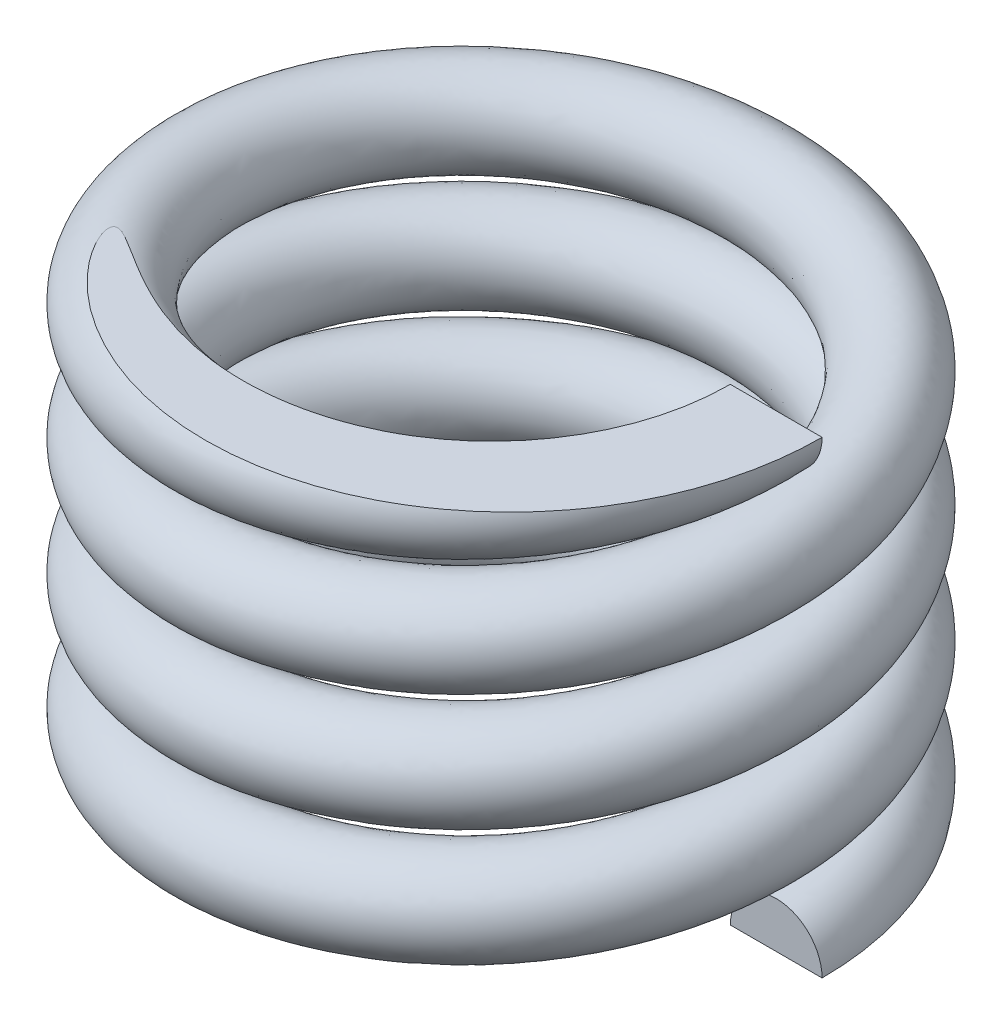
ISO-10303-21;
HEADER;
FILE_DESCRIPTION(('STEP AP214'),'2;1');
FILE_NAME('part.step','',(''),(''),'','','');
FILE_SCHEMA(('AUTOMOTIVE_DESIGN { 1 0 10303 214 1 1 1 1 }'));
ENDSEC;
DATA;
#1=APPLICATION_CONTEXT('core data for automotive mechanical design processes');
#2=APPLICATION_PROTOCOL_DEFINITION('international standard','automotive_design',2000,#1);
#3=PRODUCT_CONTEXT('',#1,'mechanical');
#4=PRODUCT('Part','Part','',(#3));
#5=PRODUCT_RELATED_PRODUCT_CATEGORY('part','',(#4));
#6=PRODUCT_DEFINITION_FORMATION('','',#4);
#7=PRODUCT_DEFINITION_CONTEXT('part definition',#1,'design');
#8=PRODUCT_DEFINITION('design','',#6,#7);
#9=PRODUCT_DEFINITION_SHAPE('','',#8);
#10=(LENGTH_UNIT() NAMED_UNIT(*) SI_UNIT(.MILLI.,.METRE.));
#11=(NAMED_UNIT(*) PLANE_ANGLE_UNIT() SI_UNIT($,.RADIAN.));
#12=(NAMED_UNIT(*) SI_UNIT($,.STERADIAN.) SOLID_ANGLE_UNIT());
#13=UNCERTAINTY_MEASURE_WITH_UNIT(LENGTH_MEASURE(1.E-05),#10,'distance_accuracy_value','');
#14=(GEOMETRIC_REPRESENTATION_CONTEXT(3) GLOBAL_UNCERTAINTY_ASSIGNED_CONTEXT((#13)) GLOBAL_UNIT_ASSIGNED_CONTEXT((#10,
#11,#12)) REPRESENTATION_CONTEXT('',''));
#15=CARTESIAN_POINT('',(0.,0.,0.));
#16=DIRECTION('',(0.,0.,1.));
#17=DIRECTION('',(1.,0.,0.));
#18=AXIS2_PLACEMENT_3D('',#15,#16,#17);
#19=CARTESIAN_POINT('',(1.5,2.55182105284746,0.));
#20=DIRECTION('',(0.,0.,1.));
#21=DIRECTION('',(1.,0.,0.));
#22=AXIS2_PLACEMENT_3D('',#19,#20,#21);
#23=PLANE('',#22);
#24=DIRECTION('',(-1.,0.,0.));
#25=VECTOR('',#24,1.);
#26=CARTESIAN_POINT('',(1.5,2.55182105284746,0.));
#27=LINE('',#26,#25);
#28=CARTESIAN_POINT('',(1.75,2.55182105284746,0.));
#29=VERTEX_POINT('',#28);
#30=CARTESIAN_POINT('',(1.25,2.55182105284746,0.));
#31=VERTEX_POINT('',#30);
#32=EDGE_CURVE('E50',#29,#31,#27,.T.);
#33=ORIENTED_EDGE('',*,*,#32,.F.);
#34=CARTESIAN_POINT('',(1.5,2.55182105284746,0.));
#35=DIRECTION('',(0.,0.,1.));
#36=DIRECTION('',(1.,0.,0.));
#37=AXIS2_PLACEMENT_3D('',#34,#35,#36);
#38=CIRCLE('',#37,0.25);
#39=EDGE_CURVE('E67',#31,#29,#38,.T.);
#40=ORIENTED_EDGE('',*,*,#39,.F.);
#41=EDGE_LOOP('',(#33,#40));
#42=FACE_BOUND('',#41,.T.);
#43=ADVANCED_FACE('F32',(#42),#23,.F.);
#44=CARTESIAN_POINT('',(1.75,0.,0.));
#45=CARTESIAN_POINT('',(1.75,0.0531629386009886,-1.01036297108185));
#46=CARTESIAN_POINT('',(0.875000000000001,0.106325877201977,-1.51554445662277));
#47=CARTESIAN_POINT('',(0.,0.159488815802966,-2.02072594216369));
#48=CARTESIAN_POINT('',(-0.875,0.212651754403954,-1.51554445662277));
#49=CARTESIAN_POINT('',(-1.75,0.265814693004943,-1.01036297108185));
#50=CARTESIAN_POINT('',(-1.75,0.318977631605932,0.));
#51=CARTESIAN_POINT('',(-1.75,0.37214057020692,1.01036297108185));
#52=CARTESIAN_POINT('',(-0.875000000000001,0.425303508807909,1.51554445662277));
#53=CARTESIAN_POINT('',(0.,0.478466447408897,2.02072594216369));
#54=CARTESIAN_POINT('',(0.874999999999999,0.531629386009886,1.51554445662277));
#55=CARTESIAN_POINT('',(1.75,0.584792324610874,1.01036297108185));
#56=CARTESIAN_POINT('',(1.75,0.637955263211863,0.));
#57=CARTESIAN_POINT('',(1.75,0.691118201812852,-1.01036297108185));
#58=CARTESIAN_POINT('',(0.875000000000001,0.74428114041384,-1.51554445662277));
#59=CARTESIAN_POINT('',(0.,0.797444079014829,-2.02072594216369));
#60=CARTESIAN_POINT('',(-0.875,0.850607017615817,-1.51554445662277));
#61=CARTESIAN_POINT('',(-1.75,0.903769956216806,-1.01036297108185));
#62=CARTESIAN_POINT('',(-1.75,0.956932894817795,0.));
#63=CARTESIAN_POINT('',(-1.75,1.01009583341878,1.01036297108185));
#64=CARTESIAN_POINT('',(-0.875000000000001,1.06325877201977,1.51554445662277));
#65=CARTESIAN_POINT('',(0.,1.11642171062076,2.02072594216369));
#66=CARTESIAN_POINT('',(0.874999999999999,1.16958464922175,1.51554445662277));
#67=CARTESIAN_POINT('',(1.75,1.22274758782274,1.01036297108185));
#68=CARTESIAN_POINT('',(1.75,1.27591052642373,0.));
#69=CARTESIAN_POINT('',(1.75,1.32907346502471,-1.01036297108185));
#70=CARTESIAN_POINT('',(0.875000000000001,1.3822364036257,-1.51554445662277));
#71=CARTESIAN_POINT('',(0.,1.43539934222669,-2.02072594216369));
#72=CARTESIAN_POINT('',(-0.875,1.48856228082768,-1.51554445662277));
#73=CARTESIAN_POINT('',(-1.75,1.54172521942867,-1.01036297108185));
#74=CARTESIAN_POINT('',(-1.75,1.59488815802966,0.));
#75=CARTESIAN_POINT('',(-1.75,1.64805109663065,1.01036297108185));
#76=CARTESIAN_POINT('',(-0.875000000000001,1.70121403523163,1.51554445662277));
#77=CARTESIAN_POINT('',(0.,1.75437697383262,2.02072594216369));
#78=CARTESIAN_POINT('',(0.874999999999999,1.80753991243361,1.51554445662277));
#79=CARTESIAN_POINT('',(1.75,1.8607028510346,1.01036297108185));
#80=CARTESIAN_POINT('',(1.75,1.91386578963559,0.));
#81=CARTESIAN_POINT('',(1.75,1.96702872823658,-1.01036297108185));
#82=CARTESIAN_POINT('',(0.875000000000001,2.02019166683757,-1.51554445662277));
#83=CARTESIAN_POINT('',(0.,2.07335460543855,-2.02072594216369));
#84=CARTESIAN_POINT('',(-0.875,2.12651754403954,-1.51554445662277));
#85=CARTESIAN_POINT('',(-1.75,2.17968048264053,-1.01036297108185));
#86=CARTESIAN_POINT('',(-1.75,2.23284342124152,0.));
#87=CARTESIAN_POINT('',(-1.75,2.28600635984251,1.01036297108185));
#88=CARTESIAN_POINT('',(-0.875000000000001,2.3391692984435,1.51554445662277));
#89=CARTESIAN_POINT('',(0.,2.39233223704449,2.02072594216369));
#90=CARTESIAN_POINT('',(0.874999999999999,2.44549517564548,1.51554445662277));
#91=CARTESIAN_POINT('',(1.75,2.49865811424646,1.01036297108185));
#92=CARTESIAN_POINT('',(1.75,2.55182105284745,0.));
#93=CARTESIAN_POINT('',(1.75,0.5,0.));
#94=CARTESIAN_POINT('',(1.75,0.553162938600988,-1.01036297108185));
#95=CARTESIAN_POINT('',(0.875000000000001,0.606325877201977,-1.51554445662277));
#96=CARTESIAN_POINT('',(0.,0.659488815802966,-2.02072594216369));
#97=CARTESIAN_POINT('',(-0.875,0.712651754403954,-1.51554445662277));
#98=CARTESIAN_POINT('',(-1.75,0.765814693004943,-1.01036297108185));
#99=CARTESIAN_POINT('',(-1.75,0.818977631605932,0.));
#100=CARTESIAN_POINT('',(-1.75,0.87214057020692,1.01036297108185));
#101=CARTESIAN_POINT('',(-0.875000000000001,0.925303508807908,1.51554445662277));
#102=CARTESIAN_POINT('',(0.,0.978466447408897,2.02072594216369));
#103=CARTESIAN_POINT('',(0.874999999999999,1.03162938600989,1.51554445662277));
#104=CARTESIAN_POINT('',(1.75,1.08479232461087,1.01036297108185));
#105=CARTESIAN_POINT('',(1.75,1.13795526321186,0.));
#106=CARTESIAN_POINT('',(1.75,1.19111820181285,-1.01036297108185));
#107=CARTESIAN_POINT('',(0.875000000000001,1.24428114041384,-1.51554445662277));
#108=CARTESIAN_POINT('',(0.,1.29744407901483,-2.02072594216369));
#109=CARTESIAN_POINT('',(-0.875,1.35060701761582,-1.51554445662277));
#110=CARTESIAN_POINT('',(-1.75,1.40376995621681,-1.01036297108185));
#111=CARTESIAN_POINT('',(-1.75,1.45693289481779,0.));
#112=CARTESIAN_POINT('',(-1.75,1.51009583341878,1.01036297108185));
#113=CARTESIAN_POINT('',(-0.875000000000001,1.56325877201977,1.51554445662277));
#114=CARTESIAN_POINT('',(0.,1.61642171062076,2.02072594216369));
#115=CARTESIAN_POINT('',(0.874999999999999,1.66958464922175,1.51554445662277));
#116=CARTESIAN_POINT('',(1.75,1.72274758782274,1.01036297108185));
#117=CARTESIAN_POINT('',(1.75,1.77591052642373,0.));
#118=CARTESIAN_POINT('',(1.75,1.82907346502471,-1.01036297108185));
#119=CARTESIAN_POINT('',(0.875000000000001,1.8822364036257,-1.51554445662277));
#120=CARTESIAN_POINT('',(0.,1.93539934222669,-2.02072594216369));
#121=CARTESIAN_POINT('',(-0.875,1.98856228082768,-1.51554445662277));
#122=CARTESIAN_POINT('',(-1.75,2.04172521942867,-1.01036297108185));
#123=CARTESIAN_POINT('',(-1.75,2.09488815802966,0.));
#124=CARTESIAN_POINT('',(-1.75,2.14805109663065,1.01036297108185));
#125=CARTESIAN_POINT('',(-0.875000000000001,2.20121403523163,1.51554445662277));
#126=CARTESIAN_POINT('',(0.,2.25437697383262,2.02072594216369));
#127=CARTESIAN_POINT('',(0.874999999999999,2.30753991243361,1.51554445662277));
#128=CARTESIAN_POINT('',(1.75,2.3607028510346,1.01036297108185));
#129=CARTESIAN_POINT('',(1.75,2.41386578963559,0.));
#130=CARTESIAN_POINT('',(1.75,2.46702872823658,-1.01036297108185));
#131=CARTESIAN_POINT('',(0.875000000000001,2.52019166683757,-1.51554445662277));
#132=CARTESIAN_POINT('',(0.,2.57335460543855,-2.02072594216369));
#133=CARTESIAN_POINT('',(-0.875,2.62651754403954,-1.51554445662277));
#134=CARTESIAN_POINT('',(-1.75,2.67968048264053,-1.01036297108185));
#135=CARTESIAN_POINT('',(-1.75,2.73284342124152,0.));
#136=CARTESIAN_POINT('',(-1.75,2.78600635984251,1.01036297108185));
#137=CARTESIAN_POINT('',(-0.875000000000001,2.8391692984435,1.51554445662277));
#138=CARTESIAN_POINT('',(0.,2.89233223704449,2.02072594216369));
#139=CARTESIAN_POINT('',(0.874999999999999,2.94549517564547,1.51554445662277));
#140=CARTESIAN_POINT('',(1.75,2.99865811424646,1.01036297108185));
#141=CARTESIAN_POINT('',(1.75,3.05182105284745,0.));
#142=CARTESIAN_POINT('',(1.25,0.5,0.));
#143=CARTESIAN_POINT('',(1.25,0.553162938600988,-0.721687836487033));
#144=CARTESIAN_POINT('',(0.625000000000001,0.606325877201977,-1.08253175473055));
#145=CARTESIAN_POINT('',(0.,0.659488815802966,-1.44337567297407));
#146=CARTESIAN_POINT('',(-0.625,0.712651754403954,-1.08253175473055));
#147=CARTESIAN_POINT('',(-1.25,0.765814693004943,-0.721687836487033));
#148=CARTESIAN_POINT('',(-1.25,0.818977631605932,0.));
#149=CARTESIAN_POINT('',(-1.25,0.87214057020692,0.721687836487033));
#150=CARTESIAN_POINT('',(-0.625000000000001,0.925303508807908,1.08253175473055));
#151=CARTESIAN_POINT('',(0.,0.978466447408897,1.44337567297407));
#152=CARTESIAN_POINT('',(0.625,1.03162938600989,1.08253175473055));
#153=CARTESIAN_POINT('',(1.25,1.08479232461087,0.721687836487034));
#154=CARTESIAN_POINT('',(1.25,1.13795526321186,0.));
#155=CARTESIAN_POINT('',(1.25,1.19111820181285,-0.721687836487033));
#156=CARTESIAN_POINT('',(0.625000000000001,1.24428114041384,-1.08253175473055));
#157=CARTESIAN_POINT('',(0.,1.29744407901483,-1.44337567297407));
#158=CARTESIAN_POINT('',(-0.625,1.35060701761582,-1.08253175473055));
#159=CARTESIAN_POINT('',(-1.25,1.40376995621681,-0.721687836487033));
#160=CARTESIAN_POINT('',(-1.25,1.45693289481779,0.));
#161=CARTESIAN_POINT('',(-1.25,1.51009583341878,0.721687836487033));
#162=CARTESIAN_POINT('',(-0.625000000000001,1.56325877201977,1.08253175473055));
#163=CARTESIAN_POINT('',(0.,1.61642171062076,1.44337567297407));
#164=CARTESIAN_POINT('',(0.625,1.66958464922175,1.08253175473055));
#165=CARTESIAN_POINT('',(1.25,1.72274758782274,0.721687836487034));
#166=CARTESIAN_POINT('',(1.25,1.77591052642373,0.));
#167=CARTESIAN_POINT('',(1.25,1.82907346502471,-0.721687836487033));
#168=CARTESIAN_POINT('',(0.625000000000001,1.8822364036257,-1.08253175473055));
#169=CARTESIAN_POINT('',(0.,1.93539934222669,-1.44337567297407));
#170=CARTESIAN_POINT('',(-0.625,1.98856228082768,-1.08253175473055));
#171=CARTESIAN_POINT('',(-1.25,2.04172521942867,-0.721687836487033));
#172=CARTESIAN_POINT('',(-1.25,2.09488815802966,0.));
#173=CARTESIAN_POINT('',(-1.25,2.14805109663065,0.721687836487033));
#174=CARTESIAN_POINT('',(-0.625000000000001,2.20121403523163,1.08253175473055));
#175=CARTESIAN_POINT('',(0.,2.25437697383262,1.44337567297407));
#176=CARTESIAN_POINT('',(0.625,2.30753991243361,1.08253175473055));
#177=CARTESIAN_POINT('',(1.25,2.3607028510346,0.721687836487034));
#178=CARTESIAN_POINT('',(1.25,2.41386578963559,0.));
#179=CARTESIAN_POINT('',(1.25,2.46702872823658,-0.721687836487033));
#180=CARTESIAN_POINT('',(0.625000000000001,2.52019166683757,-1.08253175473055));
#181=CARTESIAN_POINT('',(0.,2.57335460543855,-1.44337567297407));
#182=CARTESIAN_POINT('',(-0.625,2.62651754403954,-1.08253175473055));
#183=CARTESIAN_POINT('',(-1.25,2.67968048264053,-0.721687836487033));
#184=CARTESIAN_POINT('',(-1.25,2.73284342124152,0.));
#185=CARTESIAN_POINT('',(-1.25,2.78600635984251,0.721687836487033));
#186=CARTESIAN_POINT('',(-0.625000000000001,2.8391692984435,1.08253175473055));
#187=CARTESIAN_POINT('',(0.,2.89233223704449,1.44337567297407));
#188=CARTESIAN_POINT('',(0.625,2.94549517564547,1.08253175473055));
#189=CARTESIAN_POINT('',(1.25,2.99865811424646,0.721687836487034));
#190=CARTESIAN_POINT('',(1.25,3.05182105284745,0.));
#191=CARTESIAN_POINT('',(1.25,0.,0.));
#192=CARTESIAN_POINT('',(1.25,0.0531629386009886,-0.721687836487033));
#193=CARTESIAN_POINT('',(0.625000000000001,0.106325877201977,-1.08253175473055));
#194=CARTESIAN_POINT('',(0.,0.159488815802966,-1.44337567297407));
#195=CARTESIAN_POINT('',(-0.625,0.212651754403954,-1.08253175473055));
#196=CARTESIAN_POINT('',(-1.25,0.265814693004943,-0.721687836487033));
#197=CARTESIAN_POINT('',(-1.25,0.318977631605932,0.));
#198=CARTESIAN_POINT('',(-1.25,0.37214057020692,0.721687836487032));
#199=CARTESIAN_POINT('',(-0.625000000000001,0.425303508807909,1.08253175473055));
#200=CARTESIAN_POINT('',(0.,0.478466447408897,1.44337567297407));
#201=CARTESIAN_POINT('',(0.625,0.531629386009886,1.08253175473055));
#202=CARTESIAN_POINT('',(1.25,0.584792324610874,0.721687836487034));
#203=CARTESIAN_POINT('',(1.25,0.637955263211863,0.));
#204=CARTESIAN_POINT('',(1.25,0.691118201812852,-0.721687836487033));
#205=CARTESIAN_POINT('',(0.625000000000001,0.74428114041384,-1.08253175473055));
#206=CARTESIAN_POINT('',(0.,0.797444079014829,-1.44337567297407));
#207=CARTESIAN_POINT('',(-0.625,0.850607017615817,-1.08253175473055));
#208=CARTESIAN_POINT('',(-1.25,0.903769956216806,-0.721687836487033));
#209=CARTESIAN_POINT('',(-1.25,0.956932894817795,0.));
#210=CARTESIAN_POINT('',(-1.25,1.01009583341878,0.721687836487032));
#211=CARTESIAN_POINT('',(-0.625000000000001,1.06325877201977,1.08253175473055));
#212=CARTESIAN_POINT('',(0.,1.11642171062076,1.44337567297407));
#213=CARTESIAN_POINT('',(0.625,1.16958464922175,1.08253175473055));
#214=CARTESIAN_POINT('',(1.25,1.22274758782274,0.721687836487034));
#215=CARTESIAN_POINT('',(1.25,1.27591052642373,0.));
#216=CARTESIAN_POINT('',(1.25,1.32907346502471,-0.721687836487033));
#217=CARTESIAN_POINT('',(0.625000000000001,1.3822364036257,-1.08253175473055));
#218=CARTESIAN_POINT('',(0.,1.43539934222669,-1.44337567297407));
#219=CARTESIAN_POINT('',(-0.625,1.48856228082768,-1.08253175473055));
#220=CARTESIAN_POINT('',(-1.25,1.54172521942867,-0.721687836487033));
#221=CARTESIAN_POINT('',(-1.25,1.59488815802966,0.));
#222=CARTESIAN_POINT('',(-1.25,1.64805109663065,0.721687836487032));
#223=CARTESIAN_POINT('',(-0.625000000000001,1.70121403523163,1.08253175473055));
#224=CARTESIAN_POINT('',(0.,1.75437697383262,1.44337567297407));
#225=CARTESIAN_POINT('',(0.625,1.80753991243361,1.08253175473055));
#226=CARTESIAN_POINT('',(1.25,1.8607028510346,0.721687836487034));
#227=CARTESIAN_POINT('',(1.25,1.91386578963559,0.));
#228=CARTESIAN_POINT('',(1.25,1.96702872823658,-0.721687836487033));
#229=CARTESIAN_POINT('',(0.625000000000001,2.02019166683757,-1.08253175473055));
#230=CARTESIAN_POINT('',(0.,2.07335460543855,-1.44337567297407));
#231=CARTESIAN_POINT('',(-0.625,2.12651754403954,-1.08253175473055));
#232=CARTESIAN_POINT('',(-1.25,2.17968048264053,-0.721687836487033));
#233=CARTESIAN_POINT('',(-1.25,2.23284342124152,0.));
#234=CARTESIAN_POINT('',(-1.25,2.28600635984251,0.721687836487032));
#235=CARTESIAN_POINT('',(-0.625000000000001,2.3391692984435,1.08253175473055));
#236=CARTESIAN_POINT('',(0.,2.39233223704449,1.44337567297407));
#237=CARTESIAN_POINT('',(0.625,2.44549517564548,1.08253175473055));
#238=CARTESIAN_POINT('',(1.25,2.49865811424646,0.721687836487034));
#239=CARTESIAN_POINT('',(1.25,2.55182105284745,0.));
#240=CARTESIAN_POINT('',(1.25,-0.5,0.));
#241=CARTESIAN_POINT('',(1.25,-0.446837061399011,-0.721687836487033));
#242=CARTESIAN_POINT('',(0.625000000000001,-0.393674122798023,-1.08253175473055));
#243=CARTESIAN_POINT('',(0.,-0.340511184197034,-1.44337567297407));
#244=CARTESIAN_POINT('',(-0.625,-0.287348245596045,-1.08253175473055));
#245=CARTESIAN_POINT('',(-1.25,-0.234185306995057,-0.721687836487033));
#246=CARTESIAN_POINT('',(-1.25,-0.181022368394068,0.));
#247=CARTESIAN_POINT('',(-1.25,-0.12785942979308,0.721687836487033));
#248=CARTESIAN_POINT('',(-0.625000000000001,-0.074696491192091,1.08253175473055));
#249=CARTESIAN_POINT('',(0.,-0.0215335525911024,1.44337567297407));
#250=CARTESIAN_POINT('',(0.625,0.0316293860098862,1.08253175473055));
#251=CARTESIAN_POINT('',(1.25,0.0847923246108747,0.721687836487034));
#252=CARTESIAN_POINT('',(1.25,0.137955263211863,0.));
#253=CARTESIAN_POINT('',(1.25,0.191118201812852,-0.721687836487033));
#254=CARTESIAN_POINT('',(0.625000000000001,0.244281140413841,-1.08253175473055));
#255=CARTESIAN_POINT('',(0.,0.297444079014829,-1.44337567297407));
#256=CARTESIAN_POINT('',(-0.625,0.350607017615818,-1.08253175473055));
#257=CARTESIAN_POINT('',(-1.25,0.403769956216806,-0.721687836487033));
#258=CARTESIAN_POINT('',(-1.25,0.456932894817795,0.));
#259=CARTESIAN_POINT('',(-1.25,0.510095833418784,0.721687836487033));
#260=CARTESIAN_POINT('',(-0.625000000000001,0.563258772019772,1.08253175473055));
#261=CARTESIAN_POINT('',(0.,0.616421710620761,1.44337567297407));
#262=CARTESIAN_POINT('',(0.625,0.669584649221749,1.08253175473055));
#263=CARTESIAN_POINT('',(1.25,0.722747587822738,0.721687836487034));
#264=CARTESIAN_POINT('',(1.25,0.775910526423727,0.));
#265=CARTESIAN_POINT('',(1.25,0.829073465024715,-0.721687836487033));
#266=CARTESIAN_POINT('',(0.625000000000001,0.882236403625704,-1.08253175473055));
#267=CARTESIAN_POINT('',(0.,0.935399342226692,-1.44337567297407));
#268=CARTESIAN_POINT('',(-0.625,0.988562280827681,-1.08253175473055));
#269=CARTESIAN_POINT('',(-1.25,1.04172521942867,-0.721687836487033));
#270=CARTESIAN_POINT('',(-1.25,1.09488815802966,0.));
#271=CARTESIAN_POINT('',(-1.25,1.14805109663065,0.721687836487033));
#272=CARTESIAN_POINT('',(-0.625000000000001,1.20121403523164,1.08253175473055));
#273=CARTESIAN_POINT('',(0.,1.25437697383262,1.44337567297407));
#274=CARTESIAN_POINT('',(0.625,1.30753991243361,1.08253175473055));
#275=CARTESIAN_POINT('',(1.25,1.3607028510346,0.721687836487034));
#276=CARTESIAN_POINT('',(1.25,1.41386578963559,0.));
#277=CARTESIAN_POINT('',(1.25,1.46702872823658,-0.721687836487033));
#278=CARTESIAN_POINT('',(0.625000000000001,1.52019166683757,-1.08253175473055));
#279=CARTESIAN_POINT('',(0.,1.57335460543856,-1.44337567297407));
#280=CARTESIAN_POINT('',(-0.625,1.62651754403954,-1.08253175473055));
#281=CARTESIAN_POINT('',(-1.25,1.67968048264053,-0.721687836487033));
#282=CARTESIAN_POINT('',(-1.25,1.73284342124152,0.));
#283=CARTESIAN_POINT('',(-1.25,1.78600635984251,0.721687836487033));
#284=CARTESIAN_POINT('',(-0.625000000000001,1.8391692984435,1.08253175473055));
#285=CARTESIAN_POINT('',(0.,1.89233223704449,1.44337567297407));
#286=CARTESIAN_POINT('',(0.625,1.94549517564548,1.08253175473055));
#287=CARTESIAN_POINT('',(1.25,1.99865811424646,0.721687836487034));
#288=CARTESIAN_POINT('',(1.25,2.05182105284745,0.));
#289=CARTESIAN_POINT('',(1.75,-0.5,0.));
#290=CARTESIAN_POINT('',(1.75,-0.446837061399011,-1.01036297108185));
#291=CARTESIAN_POINT('',(0.875000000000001,-0.393674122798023,-1.51554445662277));
#292=CARTESIAN_POINT('',(0.,-0.340511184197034,-2.02072594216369));
#293=CARTESIAN_POINT('',(-0.875,-0.287348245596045,-1.51554445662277));
#294=CARTESIAN_POINT('',(-1.75,-0.234185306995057,-1.01036297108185));
#295=CARTESIAN_POINT('',(-1.75,-0.181022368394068,0.));
#296=CARTESIAN_POINT('',(-1.75,-0.12785942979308,1.01036297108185));
#297=CARTESIAN_POINT('',(-0.875000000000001,-0.074696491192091,1.51554445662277));
#298=CARTESIAN_POINT('',(0.,-0.0215335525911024,2.02072594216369));
#299=CARTESIAN_POINT('',(0.874999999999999,0.0316293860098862,1.51554445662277));
#300=CARTESIAN_POINT('',(1.75,0.0847923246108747,1.01036297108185));
#301=CARTESIAN_POINT('',(1.75,0.137955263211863,0.));
#302=CARTESIAN_POINT('',(1.75,0.191118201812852,-1.01036297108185));
#303=CARTESIAN_POINT('',(0.875000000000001,0.244281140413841,-1.51554445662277));
#304=CARTESIAN_POINT('',(0.,0.297444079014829,-2.02072594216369));
#305=CARTESIAN_POINT('',(-0.875,0.350607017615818,-1.51554445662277));
#306=CARTESIAN_POINT('',(-1.75,0.403769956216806,-1.01036297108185));
#307=CARTESIAN_POINT('',(-1.75,0.456932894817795,0.));
#308=CARTESIAN_POINT('',(-1.75,0.510095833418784,1.01036297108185));
#309=CARTESIAN_POINT('',(-0.875000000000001,0.563258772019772,1.51554445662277));
#310=CARTESIAN_POINT('',(0.,0.616421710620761,2.02072594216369));
#311=CARTESIAN_POINT('',(0.874999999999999,0.669584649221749,1.51554445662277));
#312=CARTESIAN_POINT('',(1.75,0.722747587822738,1.01036297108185));
#313=CARTESIAN_POINT('',(1.75,0.775910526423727,0.));
#314=CARTESIAN_POINT('',(1.75,0.829073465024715,-1.01036297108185));
#315=CARTESIAN_POINT('',(0.875000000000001,0.882236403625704,-1.51554445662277));
#316=CARTESIAN_POINT('',(0.,0.935399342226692,-2.02072594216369));
#317=CARTESIAN_POINT('',(-0.875,0.988562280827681,-1.51554445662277));
#318=CARTESIAN_POINT('',(-1.75,1.04172521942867,-1.01036297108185));
#319=CARTESIAN_POINT('',(-1.75,1.09488815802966,0.));
#320=CARTESIAN_POINT('',(-1.75,1.14805109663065,1.01036297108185));
#321=CARTESIAN_POINT('',(-0.875000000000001,1.20121403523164,1.51554445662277));
#322=CARTESIAN_POINT('',(0.,1.25437697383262,2.02072594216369));
#323=CARTESIAN_POINT('',(0.874999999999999,1.30753991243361,1.51554445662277));
#324=CARTESIAN_POINT('',(1.75,1.3607028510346,1.01036297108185));
#325=CARTESIAN_POINT('',(1.75,1.41386578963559,0.));
#326=CARTESIAN_POINT('',(1.75,1.46702872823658,-1.01036297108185));
#327=CARTESIAN_POINT('',(0.875000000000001,1.52019166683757,-1.51554445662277));
#328=CARTESIAN_POINT('',(0.,1.57335460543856,-2.02072594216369));
#329=CARTESIAN_POINT('',(-0.875,1.62651754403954,-1.51554445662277));
#330=CARTESIAN_POINT('',(-1.75,1.67968048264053,-1.01036297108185));
#331=CARTESIAN_POINT('',(-1.75,1.73284342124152,0.));
#332=CARTESIAN_POINT('',(-1.75,1.78600635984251,1.01036297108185));
#333=CARTESIAN_POINT('',(-0.875000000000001,1.8391692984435,1.51554445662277));
#334=CARTESIAN_POINT('',(0.,1.89233223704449,2.02072594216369));
#335=CARTESIAN_POINT('',(0.874999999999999,1.94549517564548,1.51554445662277));
#336=CARTESIAN_POINT('',(1.75,1.99865811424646,1.01036297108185));
#337=CARTESIAN_POINT('',(1.75,2.05182105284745,0.));
#338=CARTESIAN_POINT('',(1.75,0.,0.));
#339=CARTESIAN_POINT('',(1.75,0.0531629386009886,-1.01036297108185));
#340=CARTESIAN_POINT('',(0.875000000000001,0.106325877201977,-1.51554445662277));
#341=CARTESIAN_POINT('',(0.,0.159488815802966,-2.02072594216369));
#342=CARTESIAN_POINT('',(-0.875,0.212651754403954,-1.51554445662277));
#343=CARTESIAN_POINT('',(-1.75,0.265814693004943,-1.01036297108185));
#344=CARTESIAN_POINT('',(-1.75,0.318977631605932,0.));
#345=CARTESIAN_POINT('',(-1.75,0.37214057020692,1.01036297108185));
#346=CARTESIAN_POINT('',(-0.875000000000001,0.425303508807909,1.51554445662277));
#347=CARTESIAN_POINT('',(0.,0.478466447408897,2.02072594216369));
#348=CARTESIAN_POINT('',(0.874999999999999,0.531629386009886,1.51554445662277));
#349=CARTESIAN_POINT('',(1.75,0.584792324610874,1.01036297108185));
#350=CARTESIAN_POINT('',(1.75,0.637955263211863,0.));
#351=CARTESIAN_POINT('',(1.75,0.691118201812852,-1.01036297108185));
#352=CARTESIAN_POINT('',(0.875000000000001,0.74428114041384,-1.51554445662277));
#353=CARTESIAN_POINT('',(0.,0.797444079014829,-2.02072594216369));
#354=CARTESIAN_POINT('',(-0.875,0.850607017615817,-1.51554445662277));
#355=CARTESIAN_POINT('',(-1.75,0.903769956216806,-1.01036297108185));
#356=CARTESIAN_POINT('',(-1.75,0.956932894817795,0.));
#357=CARTESIAN_POINT('',(-1.75,1.01009583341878,1.01036297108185));
#358=CARTESIAN_POINT('',(-0.875000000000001,1.06325877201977,1.51554445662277));
#359=CARTESIAN_POINT('',(0.,1.11642171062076,2.02072594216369));
#360=CARTESIAN_POINT('',(0.874999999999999,1.16958464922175,1.51554445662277));
#361=CARTESIAN_POINT('',(1.75,1.22274758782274,1.01036297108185));
#362=CARTESIAN_POINT('',(1.75,1.27591052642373,0.));
#363=CARTESIAN_POINT('',(1.75,1.32907346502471,-1.01036297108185));
#364=CARTESIAN_POINT('',(0.875000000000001,1.3822364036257,-1.51554445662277));
#365=CARTESIAN_POINT('',(0.,1.43539934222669,-2.02072594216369));
#366=CARTESIAN_POINT('',(-0.875,1.48856228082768,-1.51554445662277));
#367=CARTESIAN_POINT('',(-1.75,1.54172521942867,-1.01036297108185));
#368=CARTESIAN_POINT('',(-1.75,1.59488815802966,0.));
#369=CARTESIAN_POINT('',(-1.75,1.64805109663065,1.01036297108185));
#370=CARTESIAN_POINT('',(-0.875000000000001,1.70121403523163,1.51554445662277));
#371=CARTESIAN_POINT('',(0.,1.75437697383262,2.02072594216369));
#372=CARTESIAN_POINT('',(0.874999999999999,1.80753991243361,1.51554445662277));
#373=CARTESIAN_POINT('',(1.75,1.8607028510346,1.01036297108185));
#374=CARTESIAN_POINT('',(1.75,1.91386578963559,0.));
#375=CARTESIAN_POINT('',(1.75,1.96702872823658,-1.01036297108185));
#376=CARTESIAN_POINT('',(0.875000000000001,2.02019166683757,-1.51554445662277));
#377=CARTESIAN_POINT('',(0.,2.07335460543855,-2.02072594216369));
#378=CARTESIAN_POINT('',(-0.875,2.12651754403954,-1.51554445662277));
#379=CARTESIAN_POINT('',(-1.75,2.17968048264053,-1.01036297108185));
#380=CARTESIAN_POINT('',(-1.75,2.23284342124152,0.));
#381=CARTESIAN_POINT('',(-1.75,2.28600635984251,1.01036297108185));
#382=CARTESIAN_POINT('',(-0.875000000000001,2.3391692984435,1.51554445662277));
#383=CARTESIAN_POINT('',(0.,2.39233223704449,2.02072594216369));
#384=CARTESIAN_POINT('',(0.874999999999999,2.44549517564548,1.51554445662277));
#385=CARTESIAN_POINT('',(1.75,2.49865811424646,1.01036297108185));
#386=CARTESIAN_POINT('',(1.75,2.55182105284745,0.));
#387=(BOUNDED_SURFACE() B_SPLINE_SURFACE(3,2,((#44,#45,#46,#47,#48,#49,#50,#51,#52,#53,#54,#55,
#56,#57,#58,#59,#60,#61,#62,#63,#64,#65,#66,#67,#68,#69,#70,#71,#72,#73,#74,#75,#76,#77,#78,#79,
#80,#81,#82,#83,#84,#85,#86,#87,#88,#89,#90,#91,#92),(#93,#94,#95,#96,#97,#98,#99,#100,#101,
#102,#103,#104,#105,#106,#107,#108,#109,#110,#111,#112,#113,#114,#115,#116,#117,#118,#119,#120,
#121,#122,#123,#124,#125,#126,#127,#128,#129,#130,#131,#132,#133,#134,#135,#136,#137,#138,#139,
#140,#141),(#142,#143,#144,#145,#146,#147,#148,#149,#150,#151,#152,#153,#154,#155,#156,#157,
#158,#159,#160,#161,#162,#163,#164,#165,#166,#167,#168,#169,#170,#171,#172,#173,#174,#175,#176,
#177,#178,#179,#180,#181,#182,#183,#184,#185,#186,#187,#188,#189,#190),(#191,#192,#193,#194,
#195,#196,#197,#198,#199,#200,#201,#202,#203,#204,#205,#206,#207,#208,#209,#210,#211,#212,#213,
#214,#215,#216,#217,#218,#219,#220,#221,#222,#223,#224,#225,#226,#227,#228,#229,#230,#231,#232,
#233,#234,#235,#236,#237,#238,#239),(#240,#241,#242,#243,#244,#245,#246,#247,#248,#249,#250,
#251,#252,#253,#254,#255,#256,#257,#258,#259,#260,#261,#262,#263,#264,#265,#266,#267,#268,#269,
#270,#271,#272,#273,#274,#275,#276,#277,#278,#279,#280,#281,#282,#283,#284,#285,#286,#287,#288),
(#289,#290,#291,#292,#293,#294,#295,#296,#297,#298,#299,#300,#301,#302,#303,#304,#305,#306,#307,
#308,#309,#310,#311,#312,#313,#314,#315,#316,#317,#318,#319,#320,#321,#322,#323,#324,#325,#326,
#327,#328,#329,#330,#331,#332,#333,#334,#335,#336,#337),(#338,#339,#340,#341,#342,#343,#344,
#345,#346,#347,#348,#349,#350,#351,#352,#353,#354,#355,#356,#357,#358,#359,#360,#361,#362,#363,
#364,#365,#366,#367,#368,#369,#370,#371,#372,#373,#374,#375,#376,#377,#378,#379,#380,#381,#382,
#383,#384,#385,#386)),.UNSPECIFIED.,.T.,.F.,.F.) B_SPLINE_SURFACE_WITH_KNOTS((4,3,4),(3,2,2,2,2,
2,2,2,2,2,2,2,2,2,2,2,2,2,2,2,2,2,2,2,3),(0.,0.5,1.),(0.,0.0416666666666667,0.0833333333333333,
0.125,0.166666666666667,0.208333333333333,0.25,0.291666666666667,0.333333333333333,0.375,
0.416666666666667,0.458333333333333,0.5,0.541666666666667,0.583333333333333,0.625,
0.666666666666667,0.708333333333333,0.75,0.791666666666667,0.833333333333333,0.875,
0.916666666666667,0.958333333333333,1.),
.UNSPECIFIED.) GEOMETRIC_REPRESENTATION_ITEM() RATIONAL_B_SPLINE_SURFACE(((1.,0.866025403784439,
1.,0.866025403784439,1.,0.866025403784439,1.,0.866025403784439,1.,0.866025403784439,1.,
0.866025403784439,1.,0.866025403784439,1.,0.866025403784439,1.,0.866025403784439,1.,
0.866025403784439,1.,0.866025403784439,1.,0.866025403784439,1.,0.866025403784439,1.,
0.866025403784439,1.,0.866025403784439,1.,0.866025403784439,1.,0.866025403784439,1.,
0.866025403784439,1.,0.866025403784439,1.,0.866025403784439,1.,0.866025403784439,1.,
0.866025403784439,1.,0.866025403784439,1.,0.866025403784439,1.),(0.333333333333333,
0.288675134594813,0.333333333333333,0.288675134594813,0.333333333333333,0.288675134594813,
0.333333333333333,0.288675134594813,0.333333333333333,0.288675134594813,0.333333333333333,
0.288675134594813,0.333333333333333,0.288675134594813,0.333333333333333,0.288675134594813,
0.333333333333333,0.288675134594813,0.333333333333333,0.288675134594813,0.333333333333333,
0.288675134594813,0.333333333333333,0.288675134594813,0.333333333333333,0.288675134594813,
0.333333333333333,0.288675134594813,0.333333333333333,0.288675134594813,0.333333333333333,
0.288675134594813,0.333333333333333,0.288675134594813,0.333333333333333,0.288675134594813,
0.333333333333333,0.288675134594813,0.333333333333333,0.288675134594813,0.333333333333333,
0.288675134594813,0.333333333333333,0.288675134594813,0.333333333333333,0.288675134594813,
0.333333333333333,0.288675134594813,0.333333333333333),(0.333333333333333,0.288675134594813,
0.333333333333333,0.288675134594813,0.333333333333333,0.288675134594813,0.333333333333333,
0.288675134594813,0.333333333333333,0.288675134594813,0.333333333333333,0.288675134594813,
0.333333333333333,0.288675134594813,0.333333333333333,0.288675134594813,0.333333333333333,
0.288675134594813,0.333333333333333,0.288675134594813,0.333333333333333,0.288675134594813,
0.333333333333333,0.288675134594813,0.333333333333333,0.288675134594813,0.333333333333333,
0.288675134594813,0.333333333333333,0.288675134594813,0.333333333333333,0.288675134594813,
0.333333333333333,0.288675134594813,0.333333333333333,0.288675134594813,0.333333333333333,
0.288675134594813,0.333333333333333,0.288675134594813,0.333333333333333,0.288675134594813,
0.333333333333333,0.288675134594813,0.333333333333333,0.288675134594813,0.333333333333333,
0.288675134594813,0.333333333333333),(1.,0.866025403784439,1.,0.866025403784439,1.,
0.866025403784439,1.,0.866025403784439,1.,0.866025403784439,1.,0.866025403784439,1.,
0.866025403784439,1.,0.866025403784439,1.,0.866025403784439,1.,0.866025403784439,1.,
0.866025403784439,1.,0.866025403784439,1.,0.866025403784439,1.,0.866025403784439,1.,
0.866025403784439,1.,0.866025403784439,1.,0.866025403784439,1.,0.866025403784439,1.,
0.866025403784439,1.,0.866025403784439,1.,0.866025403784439,1.,0.866025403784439,1.,
0.866025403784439,1.,0.866025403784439,1.),(0.333333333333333,0.288675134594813,
0.333333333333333,0.288675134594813,0.333333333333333,0.288675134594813,0.333333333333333,
0.288675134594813,0.333333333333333,0.288675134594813,0.333333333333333,0.288675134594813,
0.333333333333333,0.288675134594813,0.333333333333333,0.288675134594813,0.333333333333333,
0.288675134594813,0.333333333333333,0.288675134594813,0.333333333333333,0.288675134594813,
0.333333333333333,0.288675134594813,0.333333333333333,0.288675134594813,0.333333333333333,
0.288675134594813,0.333333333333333,0.288675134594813,0.333333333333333,0.288675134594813,
0.333333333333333,0.288675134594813,0.333333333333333,0.288675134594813,0.333333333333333,
0.288675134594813,0.333333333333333,0.288675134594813,0.333333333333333,0.288675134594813,
0.333333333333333,0.288675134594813,0.333333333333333,0.288675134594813,0.333333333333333,
0.288675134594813,0.333333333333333),(0.333333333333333,0.288675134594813,0.333333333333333,
0.288675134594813,0.333333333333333,0.288675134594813,0.333333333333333,0.288675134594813,
0.333333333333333,0.288675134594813,0.333333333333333,0.288675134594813,0.333333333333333,
0.288675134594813,0.333333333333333,0.288675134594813,0.333333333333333,0.288675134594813,
0.333333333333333,0.288675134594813,0.333333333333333,0.288675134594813,0.333333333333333,
0.288675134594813,0.333333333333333,0.288675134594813,0.333333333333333,0.288675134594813,
0.333333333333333,0.288675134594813,0.333333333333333,0.288675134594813,0.333333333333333,
0.288675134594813,0.333333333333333,0.288675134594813,0.333333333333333,0.288675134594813,
0.333333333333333,0.288675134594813,0.333333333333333,0.288675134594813,0.333333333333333,
0.288675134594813,0.333333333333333,0.288675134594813,0.333333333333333,0.288675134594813,
0.333333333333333),(1.,0.866025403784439,1.,0.866025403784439,1.,0.866025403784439,1.,
0.866025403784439,1.,0.866025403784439,1.,0.866025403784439,1.,0.866025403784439,1.,
0.866025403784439,1.,0.866025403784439,1.,0.866025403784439,1.,0.866025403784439,1.,
0.866025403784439,1.,0.866025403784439,1.,0.866025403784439,1.,0.866025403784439,1.,
0.866025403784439,1.,0.866025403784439,1.,0.866025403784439,1.,0.866025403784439,1.,
0.866025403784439,1.,0.866025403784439,1.,0.866025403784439,1.,0.866025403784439,1.,
0.866025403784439,1.))) REPRESENTATION_ITEM('') SURFACE());
#388=CARTESIAN_POINT('',(1.5,0.,0.));
#389=DIRECTION('',(0.,0.,1.));
#390=DIRECTION('',(1.,0.,0.));
#391=AXIS2_PLACEMENT_3D('',#388,#389,#390);
#392=CIRCLE('',#391,0.25);
#393=CARTESIAN_POINT('',(1.75,0.,0.));
#394=VERTEX_POINT('',#393);
#395=CARTESIAN_POINT('',(1.25,0.,0.));
#396=VERTEX_POINT('',#395);
#397=EDGE_CURVE('E70',#394,#396,#392,.T.);
#398=CARTESIAN_POINT('',(1.75,0.,0.));
#399=CARTESIAN_POINT('',(1.74999988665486,0.,-0.0421168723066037));
#400=CARTESIAN_POINT('',(1.74844934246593,0.,-0.0842186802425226));
#401=CARTESIAN_POINT('',(1.74225273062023,0.,-0.168193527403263));
#402=CARTESIAN_POINT('',(1.73760667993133,0.,-0.210066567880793));
#403=CARTESIAN_POINT('',(1.71904743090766,0.,-0.334949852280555));
#404=CARTESIAN_POINT('',(1.70051310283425,-3.02700622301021E-13,-0.417321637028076));
#405=CARTESIAN_POINT('',(1.65147294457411,-3.1469692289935E-13,-0.578423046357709));
#406=CARTESIAN_POINT('',(1.62096267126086,0.,-0.657151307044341));
#407=CARTESIAN_POINT('',(1.54861182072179,0.,-0.809230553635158));
#408=CARTESIAN_POINT('',(1.50677008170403,0.,-0.882580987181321));
#409=CARTESIAN_POINT('',(1.40634810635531,0.,-1.03162623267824));
#410=CARTESIAN_POINT('',(1.34627703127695,0.,-1.10632064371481));
#411=CARTESIAN_POINT('',(1.21435349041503,0.,-1.24460601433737));
#412=CARTESIAN_POINT('',(1.14249387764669,0.,-1.30819018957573));
#413=CARTESIAN_POINT('',(1.02759665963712,0.,-1.3937510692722));
#414=CARTESIAN_POINT('',(0.988119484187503,0.,-1.42063213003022));
#415=CARTESIAN_POINT('',(0.907047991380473,0.,-1.4710102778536));
#416=CARTESIAN_POINT('',(0.865453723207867,0.,-1.4945074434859));
#417=CARTESIAN_POINT('',(0.780397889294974,0.,-1.53782451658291));
#418=CARTESIAN_POINT('',(0.736936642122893,0.,-1.55764504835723));
#419=CARTESIAN_POINT('',(0.648470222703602,0.,-1.59343380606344));
#420=CARTESIAN_POINT('',(0.603465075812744,0.,-1.60940209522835));
#421=CARTESIAN_POINT('',(0.467927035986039,0.,-1.65090271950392));
#422=CARTESIAN_POINT('',(0.375557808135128,0.,-1.67069774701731));
#423=CARTESIAN_POINT('',(0.188871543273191,0.,-1.69394314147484));
#424=CARTESIAN_POINT('',(0.0945555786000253,0.,-1.69740227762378));
#425=CARTESIAN_POINT('',(-0.0902151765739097,0.,-1.68785886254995));
#426=CARTESIAN_POINT('',(-0.180696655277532,0.,-1.67538169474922));
#427=CARTESIAN_POINT('',(-0.358303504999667,0.,-1.63497906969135));
#428=CARTESIAN_POINT('',(-0.445423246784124,0.,-1.60702880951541));
#429=CARTESIAN_POINT('',(-0.611303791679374,0.,-1.53706838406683));
#430=CARTESIAN_POINT('',(-0.690219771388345,0.,-1.49542971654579));
#431=CARTESIAN_POINT('',(-0.802046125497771,0.,-1.42323274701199));
#432=CARTESIAN_POINT('',(-0.838192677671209,0.,-1.39757882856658));
#433=CARTESIAN_POINT('',(-0.907698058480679,0.,-1.34277129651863));
#434=CARTESIAN_POINT('',(-0.941060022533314,0.,-1.31362171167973));
#435=CARTESIAN_POINT('',(-1.00114861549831,0.,-1.25505325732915));
#436=CARTESIAN_POINT('',(-1.0282046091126,2.33248085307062E-13,-1.2259747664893));
#437=CARTESIAN_POINT('',(-1.06621191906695,-1.16846035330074E-13,-1.18017863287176));
#438=CARTESIAN_POINT('',(-1.07846197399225,-3.28865280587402E-13,-1.16453430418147));
#439=CARTESIAN_POINT('',(-1.10191162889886,3.28605798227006E-13,-1.13249327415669));
#440=CARTESIAN_POINT('',(-1.1131120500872,1.1972429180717E-12,-1.11609717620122));
#441=CARTESIAN_POINT('',(-1.13421957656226,1.13843558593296E-12,-1.08243180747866));
#442=CARTESIAN_POINT('',(-1.14412463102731,2.08179019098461E-13,-1.06516121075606));
#443=CARTESIAN_POINT('',(-1.15743026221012,-1.03856484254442E-13,-1.03850625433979));
#444=CARTESIAN_POINT('',(-1.16160299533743,0.,-1.02950695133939));
#445=CARTESIAN_POINT('',(-1.16921959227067,0.,-1.01120876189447));
#446=CARTESIAN_POINT('',(-1.17266493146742,0.,-1.00191052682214));
#447=CARTESIAN_POINT('',(-1.17688693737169,0.,-0.98766940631));
#448=CARTESIAN_POINT('',(-1.17813743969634,0.,-0.982868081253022));
#449=CARTESIAN_POINT('',(-1.18015124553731,0.,-0.973171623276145));
#450=CARTESIAN_POINT('',(-1.18091661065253,0.,-0.96827697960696));
#451=CARTESIAN_POINT('',(-1.18150787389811,0.,-0.959798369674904));
#452=CARTESIAN_POINT('',(-1.18153615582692,0.,-0.956229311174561));
#453=CARTESIAN_POINT('',(-1.18082018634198,0.,-0.949083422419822));
#454=CARTESIAN_POINT('',(-1.18007029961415,0.,-0.945506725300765));
#455=CARTESIAN_POINT('',(-1.17770199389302,0.,-0.940262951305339));
#456=CARTESIAN_POINT('',(-1.17655350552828,0.,-0.938405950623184));
#457=CARTESIAN_POINT('',(-1.17364376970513,0.,-0.935212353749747));
#458=CARTESIAN_POINT('',(-1.17187906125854,1.17847333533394E-13,-0.933878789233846));
#459=CARTESIAN_POINT('',(-1.16816664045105,2.69366210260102E-13,-0.931991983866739));
#460=CARTESIAN_POINT('',(-1.16624392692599,3.36004458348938E-13,-0.931386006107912));
#461=CARTESIAN_POINT('',(-1.16073408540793,3.32702915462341E-13,-0.930315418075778));
#462=CARTESIAN_POINT('',(-1.15706573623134,1.07496257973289E-13,-0.930367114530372));
#463=CARTESIAN_POINT('',(-1.14827874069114,-1.54575494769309E-13,-0.931342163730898));
#464=CARTESIAN_POINT('',(-1.14322833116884,0.,-0.932637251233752));
#465=CARTESIAN_POINT('',(-1.13330260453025,0.,-0.935834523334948));
#466=CARTESIAN_POINT('',(-1.12842886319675,1.09276530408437E-13,-0.937741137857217));
#467=CARTESIAN_POINT('',(-1.11828110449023,0.,-0.94212324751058));
#468=CARTESIAN_POINT('',(-1.11302480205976,0.,-0.944638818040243));
#469=CARTESIAN_POINT('',(-1.10262885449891,0.,-0.949902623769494));
#470=CARTESIAN_POINT('',(-1.09748928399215,0.,-0.952651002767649));
#471=CARTESIAN_POINT('',(-1.08217075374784,0.,-0.961115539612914));
#472=CARTESIAN_POINT('',(-1.07210944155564,0.,-0.967042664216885));
#473=CARTESIAN_POINT('',(-1.05213217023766,0.,-0.97911014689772));
#474=CARTESIAN_POINT('',(-1.04221608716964,0.,-0.985250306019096));
#475=CARTESIAN_POINT('',(-1.02244325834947,0.,-0.997602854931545));
#476=CARTESIAN_POINT('',(-1.01258646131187,0.,-1.00381516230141));
#477=CARTESIAN_POINT('',(-0.982935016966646,0.,-1.02248199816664));
#478=CARTESIAN_POINT('',(-0.96313056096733,0.,-1.03492138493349));
#479=CARTESIAN_POINT('',(-0.923281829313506,0.,-1.05940958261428));
#480=CARTESIAN_POINT('',(-0.903237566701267,0.,-1.07145841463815));
#481=CARTESIAN_POINT('',(-0.842586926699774,0.,-1.10673402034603));
#482=CARTESIAN_POINT('',(-0.801464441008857,0.,-1.12908874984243));
#483=CARTESIAN_POINT('',(-0.717748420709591,0.,-1.17069800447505));
#484=CARTESIAN_POINT('',(-0.675157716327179,0.,-1.18995812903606));
#485=CARTESIAN_POINT('',(-0.588339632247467,0.,-1.22440771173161));
#486=CARTESIAN_POINT('',(-0.544112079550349,0.,-1.23959673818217));
#487=CARTESIAN_POINT('',(-0.453702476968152,0.,-1.26592384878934));
#488=CARTESIAN_POINT('',(-0.407500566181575,0.,-1.27699396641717));
#489=CARTESIAN_POINT('',(-0.314245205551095,0.,-1.2945638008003));
#490=CARTESIAN_POINT('',(-0.26719161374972,0.,-1.3010627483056));
#491=CARTESIAN_POINT('',(-0.125236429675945,0.,-1.31350046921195));
#492=CARTESIAN_POINT('',(-0.0295933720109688,0.,-1.31236461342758));
#493=CARTESIAN_POINT('',(0.145316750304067,0.,-1.29243556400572));
#494=CARTESIAN_POINT('',(0.224904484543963,0.,-1.27629255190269));
#495=CARTESIAN_POINT('',(0.379969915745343,0.,-1.23034726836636));
#496=CARTESIAN_POINT('',(0.455452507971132,0.,-1.20056168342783));
#497=CARTESIAN_POINT('',(0.597261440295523,0.,-1.12944325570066));
#498=CARTESIAN_POINT('',(0.66382453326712,0.,-1.08858351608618));
#499=CARTESIAN_POINT('',(0.788536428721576,0.,-0.995571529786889));
#500=CARTESIAN_POINT('',(0.846687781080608,0.,-0.943422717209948));
#501=CARTESIAN_POINT('',(0.950134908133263,0.,-0.832489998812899));
#502=CARTESIAN_POINT('',(0.995927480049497,0.,-0.774167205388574));
#503=CARTESIAN_POINT('',(1.07703289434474,0.,-0.650583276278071));
#504=CARTESIAN_POINT('',(1.11234000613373,0.,-0.58531837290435));
#505=CARTESIAN_POINT('',(1.17123516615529,0.,-0.450152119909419));
#506=CARTESIAN_POINT('',(1.19488868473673,0.,-0.38027923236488));
#507=CARTESIAN_POINT('',(1.23000080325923,0.,-0.237650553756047));
#508=CARTESIAN_POINT('',(1.24148530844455,0.,-0.164901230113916));
#509=CARTESIAN_POINT('',(1.24891002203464,0.,-0.0612206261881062));
#510=CARTESIAN_POINT('',(1.25000738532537,0.,-0.0306020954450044));
#511=CARTESIAN_POINT('',(1.25,0.,0.));
#512=B_SPLINE_CURVE_WITH_KNOTS('',3,(#398,#399,#400,#401,#402,#403,#404,#405,#406,#407,#408,
#409,#410,#411,#412,#413,#414,#415,#416,#417,#418,#419,#420,#421,#422,#423,#424,#425,#426,#427,
#428,#429,#430,#431,#432,#433,#434,#435,#436,#437,#438,#439,#440,#441,#442,#443,#444,#445,#446,
#447,#448,#449,#450,#451,#452,#453,#454,#455,#456,#457,#458,#459,#460,#461,#462,#463,#464,#465,
#466,#467,#468,#469,#470,#471,#472,#473,#474,#475,#476,#477,#478,#479,#480,#481,#482,#483,#484,
#485,#486,#487,#488,#489,#490,#491,#492,#493,#494,#495,#496,#497,#498,#499,#500,#501,#502,#503,
#504,#505,#506,#507,#508,#509,#510,#511),.UNSPECIFIED.,.F.,.F.,(4,2,2,2,2,2,2,2,2,2,2,2,2,2,2,2,
2,2,2,2,2,2,2,2,2,2,2,2,2,2,2,2,2,2,2,2,2,2,2,2,2,2,2,2,2,2,2,2,2,2,2,2,2,2,2,2,4),(0.,
0.12629181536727,0.25258293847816,0.504875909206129,0.757262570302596,1.00967511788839,
1.2958739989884,1.58224703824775,1.72539011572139,1.86852986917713,2.01164529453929,
2.15475837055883,2.43662340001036,2.71833710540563,2.99099864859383,3.26409853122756,
3.53032620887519,3.66313647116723,3.7957951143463,3.91471832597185,3.97429311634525,
4.03382090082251,4.09344181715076,4.12318553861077,4.1528683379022,4.16774177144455,
4.18255156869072,4.19323378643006,4.20399390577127,4.21043141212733,4.21690567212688,
4.22287510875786,4.23370215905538,4.24926971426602,4.26495268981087,4.28242368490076,
4.29990555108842,4.3349273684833,4.36991731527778,4.4048706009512,4.47503006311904,
4.5451857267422,4.68550331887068,4.82556408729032,4.96563970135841,5.10793376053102,
5.25025175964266,5.53505045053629,5.77750876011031,6.01967130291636,6.25278447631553,
6.48582683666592,6.70723703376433,6.9287680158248,7.14903981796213,7.36884176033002,
7.46067330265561),.UNSPECIFIED.);
#513=EDGE_CURVE('E45',#394,#396,#512,.T.);
#514=CARTESIAN_POINT('',(1.25,2.55182105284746,0.));
#515=CARTESIAN_POINT('',(1.24999970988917,2.55182105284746,0.0363100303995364));
#516=CARTESIAN_POINT('',(1.24845997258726,2.55182105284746,0.072601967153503));
#517=CARTESIAN_POINT('',(1.24232949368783,2.55182105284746,0.144923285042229));
#518=CARTESIAN_POINT('',(1.23773909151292,2.55182105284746,0.180952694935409));
#519=CARTESIAN_POINT('',(1.21945189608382,2.55182105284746,0.288210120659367));
#520=CARTESIAN_POINT('',(1.20123892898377,2.55182105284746,0.358719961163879));
#521=CARTESIAN_POINT('',(1.15334222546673,2.55182105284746,0.495696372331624));
#522=CARTESIAN_POINT('',(1.12365737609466,2.55182105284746,0.56216254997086));
#523=CARTESIAN_POINT('',(1.053691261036,2.55182105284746,0.689240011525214));
#524=CARTESIAN_POINT('',(1.01341230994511,2.55182105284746,0.749852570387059));
#525=CARTESIAN_POINT('',(0.922796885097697,2.55182105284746,0.864249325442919));
#526=CARTESIAN_POINT('',(0.87234788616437,2.55182105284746,0.917945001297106));
#527=CARTESIAN_POINT('',(0.79050318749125,2.55182105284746,0.991520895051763));
#528=CARTESIAN_POINT('',(0.762174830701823,2.55182105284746,1.01489647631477));
#529=CARTESIAN_POINT('',(0.703627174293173,2.55182105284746,1.05916192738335));
#530=CARTESIAN_POINT('',(0.673407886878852,2.55182105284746,1.08005181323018));
#531=CARTESIAN_POINT('',(0.611466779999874,2.55182105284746,1.11914177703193));
#532=CARTESIAN_POINT('',(0.579752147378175,2.55182105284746,1.13735327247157));
#533=CARTESIAN_POINT('',(0.514972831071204,2.55182105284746,1.17117276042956));
#534=CARTESIAN_POINT('',(0.481908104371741,2.55182105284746,1.18678066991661));
#535=CARTESIAN_POINT('',(0.381036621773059,2.55182105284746,1.2295209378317));
#536=CARTESIAN_POINT('',(0.311469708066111,2.55182105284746,1.25262185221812));
#537=CARTESIAN_POINT('',(0.166152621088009,2.55182105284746,1.28843032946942));
#538=CARTESIAN_POINT('',(0.0902663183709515,2.55182105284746,1.30057685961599));
#539=CARTESIAN_POINT('',(-0.0626841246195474,2.55182105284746,1.31239232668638));
#540=CARTESIAN_POINT('',(-0.139750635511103,2.55182105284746,1.31203154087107));
#541=CARTESIAN_POINT('',(-0.255766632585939,2.55182105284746,1.30215926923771));
#542=CARTESIAN_POINT('',(-0.295154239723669,2.55182105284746,1.29715007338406));
#543=CARTESIAN_POINT('',(-0.373385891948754,2.55182105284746,1.28391652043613));
#544=CARTESIAN_POINT('',(-0.412230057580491,2.55182105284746,1.27569288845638));
#545=CARTESIAN_POINT('',(-0.488902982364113,2.55182105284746,1.25618604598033));
#546=CARTESIAN_POINT('',(-0.526736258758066,2.55182105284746,1.24492049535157));
#547=CARTESIAN_POINT('',(-0.601395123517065,2.55182105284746,1.21938989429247));
#548=CARTESIAN_POINT('',(-0.638220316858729,2.55182105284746,1.20512368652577));
#549=CARTESIAN_POINT('',(-0.699361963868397,2.55182105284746,1.1787368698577));
#550=CARTESIAN_POINT('',(-0.723994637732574,2.55182105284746,1.1673367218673));
#551=CARTESIAN_POINT('',(-0.772755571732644,2.55182105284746,1.14350865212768));
#552=CARTESIAN_POINT('',(-0.796883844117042,2.55182105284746,1.13108075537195));
#553=CARTESIAN_POINT('',(-0.844611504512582,2.55182105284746,1.10529290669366));
#554=CARTESIAN_POINT('',(-0.868211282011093,2.55182105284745,1.09193367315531));
#555=CARTESIAN_POINT('',(-0.915068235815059,2.55182105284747,1.0644244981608));
#556=CARTESIAN_POINT('',(-0.938323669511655,2.5518210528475,1.0502716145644));
#557=CARTESIAN_POINT('',(-0.98455646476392,2.55182105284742,1.021520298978));
#558=CARTESIAN_POINT('',(-1.00753381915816,2.55182105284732,1.00692185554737));
#559=CARTESIAN_POINT('',(-1.0421611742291,2.55182105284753,0.985283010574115));
#560=CARTESIAN_POINT('',(-1.05373146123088,2.55182105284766,0.978112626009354));
#561=CARTESIAN_POINT('',(-1.07708401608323,2.55182105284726,0.964083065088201));
#562=CARTESIAN_POINT('',(-1.08886645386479,2.55182105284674,0.957224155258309));
#563=CARTESIAN_POINT('',(-1.10647398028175,2.55182105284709,0.947911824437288));
#564=CARTESIAN_POINT('',(-1.11209420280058,2.55182105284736,0.945073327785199));
#565=CARTESIAN_POINT('',(-1.12350735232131,2.55182105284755,0.939778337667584));
#566=CARTESIAN_POINT('',(-1.12929978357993,2.55182105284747,0.937320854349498));
#567=CARTESIAN_POINT('',(-1.13937322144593,2.55182105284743,0.933808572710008));
#568=CARTESIAN_POINT('',(-1.14358529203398,2.55182105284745,0.932554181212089));
#569=CARTESIAN_POINT('',(-1.15224497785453,2.55182105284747,0.930762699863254));
#570=CARTESIAN_POINT('',(-1.1566937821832,2.55182105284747,0.930229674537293));
#571=CARTESIAN_POINT('',(-1.16342675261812,2.55182105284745,0.930766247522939));
#572=CARTESIAN_POINT('',(-1.16573583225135,2.55182105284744,0.931195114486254));
#573=CARTESIAN_POINT('',(-1.17012125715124,2.55182105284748,0.932837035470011));
#574=CARTESIAN_POINT('',(-1.1721952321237,2.55182105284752,0.934057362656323));
#575=CARTESIAN_POINT('',(-1.17546102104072,2.5518210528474,0.937032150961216));
#576=CARTESIAN_POINT('',(-1.17672897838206,2.55182105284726,0.938704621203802));
#577=CARTESIAN_POINT('',(-1.17916064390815,2.55182105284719,0.943085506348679));
#578=CARTESIAN_POINT('',(-1.18005205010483,2.55182105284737,0.945932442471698));
#579=CARTESIAN_POINT('',(-1.18168585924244,2.55182105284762,0.954240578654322));
#580=CARTESIAN_POINT('',(-1.18161623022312,2.55182105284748,0.959810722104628));
#581=CARTESIAN_POINT('',(-1.18026184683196,2.55182105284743,0.974264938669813));
#582=CARTESIAN_POINT('',(-1.17824027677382,2.55182105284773,0.983029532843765));
#583=CARTESIAN_POINT('',(-1.17316673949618,2.55182105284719,1.00028404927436));
#584=CARTESIAN_POINT('',(-1.17010846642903,2.55182105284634,1.0087719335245));
#585=CARTESIAN_POINT('',(-1.16071299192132,2.55182105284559,1.03204850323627));
#586=CARTESIAN_POINT('',(-1.15368609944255,2.55182105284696,1.04655433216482));
#587=CARTESIAN_POINT('',(-1.1384709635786,2.55182105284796,1.07495163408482));
#588=CARTESIAN_POINT('',(-1.13028048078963,2.55182105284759,1.08884185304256));
#589=CARTESIAN_POINT('',(-1.11302627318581,2.55182105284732,1.11607465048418));
#590=CARTESIAN_POINT('',(-1.10396226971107,2.55182105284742,1.12941705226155));
#591=CARTESIAN_POINT('',(-1.08513993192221,2.5518210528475,1.15558104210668));
#592=CARTESIAN_POINT('',(-1.07538216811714,2.55182105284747,1.16840304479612));
#593=CARTESIAN_POINT('',(-1.04529236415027,2.55182105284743,1.20603971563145));
#594=CARTESIAN_POINT('',(-1.02406575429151,2.55182105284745,1.23014438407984));
#595=CARTESIAN_POINT('',(-0.979690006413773,2.55182105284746,1.27653004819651));
#596=CARTESIAN_POINT('',(-0.956539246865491,2.55182105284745,1.298809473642));
#597=CARTESIAN_POINT('',(-0.90859525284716,2.55182105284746,1.34155752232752));
#598=CARTESIAN_POINT('',(-0.883801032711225,2.55182105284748,1.36202504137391));
#599=CARTESIAN_POINT('',(-0.832804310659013,2.55182105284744,1.40109409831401));
#600=CARTESIAN_POINT('',(-0.806601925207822,2.55182105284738,1.41969579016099));
#601=CARTESIAN_POINT('',(-0.708022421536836,2.55182105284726,1.48503556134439));
#602=CARTESIAN_POINT('',(-0.63205626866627,2.55182105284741,1.52651599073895));
#603=CARTESIAN_POINT('',(-0.474303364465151,2.55182105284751,1.59618445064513));
#604=CARTESIAN_POINT('',(-0.39251464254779,2.55182105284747,1.62436795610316));
#605=CARTESIAN_POINT('',(-0.225198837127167,2.55182105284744,1.66701094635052));
#606=CARTESIAN_POINT('',(-0.139662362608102,2.55182105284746,1.68143361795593));
#607=CARTESIAN_POINT('',(0.0325889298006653,2.55182105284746,1.69622368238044));
#608=CARTESIAN_POINT('',(0.119303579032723,2.55182105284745,1.69659306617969));
#609=CARTESIAN_POINT('',(0.294671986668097,2.55182105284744,1.68321545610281));
#610=CARTESIAN_POINT('',(0.383288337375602,2.55182105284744,1.66897720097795));
#611=CARTESIAN_POINT('',(0.557004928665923,2.55182105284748,1.62619089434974));
#612=CARTESIAN_POINT('',(0.642104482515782,2.55182105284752,1.59764006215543));
#613=CARTESIAN_POINT('',(0.808478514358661,2.55182105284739,1.52625887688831));
#614=CARTESIAN_POINT('',(0.889613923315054,2.55182105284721,1.48310512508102));
#615=CARTESIAN_POINT('',(1.04391805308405,2.55182105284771,1.3843477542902));
#616=CARTESIAN_POINT('',(1.1170848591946,2.55182105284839,1.32874115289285));
#617=CARTESIAN_POINT('',(1.25589547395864,2.55182105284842,1.2042919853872));
#618=CARTESIAN_POINT('',(1.32118528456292,2.55182105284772,1.13505349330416));
#619=CARTESIAN_POINT('',(1.43928747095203,2.5518210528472,0.986644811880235));
#620=CARTESIAN_POINT('',(1.49209915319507,2.55182105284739,0.90747407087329));
#621=CARTESIAN_POINT('',(1.58405458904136,2.55182105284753,0.740933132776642));
#622=CARTESIAN_POINT('',(1.62311262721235,2.55182105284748,0.653515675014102));
#623=CARTESIAN_POINT('',(1.68601693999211,2.55182105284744,0.473399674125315));
#624=CARTESIAN_POINT('',(1.70987483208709,2.55182105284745,0.380705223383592));
#625=CARTESIAN_POINT('',(1.73389232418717,2.55182105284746,0.239359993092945));
#626=CARTESIAN_POINT('',(1.73993682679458,2.55182105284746,0.191639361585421));
#627=CARTESIAN_POINT('',(1.74798666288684,2.55182105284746,0.0959526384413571));
#628=CARTESIAN_POINT('',(1.74999988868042,2.55182105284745,0.0479872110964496));
#629=CARTESIAN_POINT('',(1.75,2.55182105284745,0.));
#630=B_SPLINE_CURVE_WITH_KNOTS('',3,(#514,#515,#516,#517,#518,#519,#520,#521,#522,#523,#524,
#525,#526,#527,#528,#529,#530,#531,#532,#533,#534,#535,#536,#537,#538,#539,#540,#541,#542,#543,
#544,#545,#546,#547,#548,#549,#550,#551,#552,#553,#554,#555,#556,#557,#558,#559,#560,#561,#562,
#563,#564,#565,#566,#567,#568,#569,#570,#571,#572,#573,#574,#575,#576,#577,#578,#579,#580,#581,
#582,#583,#584,#585,#586,#587,#588,#589,#590,#591,#592,#593,#594,#595,#596,#597,#598,#599,#600,
#601,#602,#603,#604,#605,#606,#607,#608,#609,#610,#611,#612,#613,#614,#615,#616,#617,#618,#619,
#620,#621,#622,#623,#624,#625,#626,#627,#628,#629),.UNSPECIFIED.,.F.,.F.,(4,2,2,2,2,2,2,2,2,2,2,
2,2,2,2,2,2,2,2,2,2,2,2,2,2,2,2,2,2,2,2,2,2,2,2,2,2,2,2,2,2,2,2,2,2,2,2,2,2,2,2,2,2,2,2,2,2,4),
(0.,0.108862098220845,0.217712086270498,0.435078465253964,0.652465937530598,0.869805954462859,
1.08969757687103,1.19977137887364,1.30984447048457,1.41943382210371,1.52902666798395,
1.74792225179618,1.97747957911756,2.2075824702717,2.32658600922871,2.44556271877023,
2.56386303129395,2.68220905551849,2.76361084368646,2.84501065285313,2.92634835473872,
3.00801058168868,3.08967490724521,3.13051371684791,3.17138683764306,3.19027287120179,
3.20910898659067,3.22228426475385,3.23553347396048,3.24249234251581,3.24951608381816,
3.25569424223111,3.26449273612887,3.28098564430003,3.30785332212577,3.33488744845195,
3.38313774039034,3.43148218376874,3.47984210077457,3.52816269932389,3.62437796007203,
3.72067514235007,3.81703061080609,3.91337812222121,4.17166054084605,4.43003079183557,
4.68909031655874,4.9481131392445,5.21614196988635,5.48422289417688,5.75867830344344,
6.03319951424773,6.31735205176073,6.60152037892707,6.88742959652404,7.17312003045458,
7.31727820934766,7.46115388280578),.UNSPECIFIED.);
#631=EDGE_CURVE('E11',#31,#29,#630,.T.);
#632=ORIENTED_EDGE('',*,*,#397,.F.);
#633=ORIENTED_EDGE('',*,*,#513,.T.);
#634=EDGE_LOOP('',(#632,#633));
#635=FACE_BOUND('',#634,.T.);
#636=ORIENTED_EDGE('',*,*,#631,.F.);
#637=ORIENTED_EDGE('',*,*,#39,.T.);
#638=EDGE_LOOP('',(#636,#637));
#639=FACE_BOUND('',#638,.T.);
#640=ADVANCED_FACE('F69',(#635,#639),#387,.F.);
#641=CARTESIAN_POINT('',(1.5,0.,0.));
#642=DIRECTION('',(0.,0.,1.));
#643=DIRECTION('',(1.,0.,0.));
#644=AXIS2_PLACEMENT_3D('',#641,#642,#643);
#645=PLANE('',#644);
#646=DIRECTION('',(-1.,0.,0.));
#647=VECTOR('',#646,1.);
#648=CARTESIAN_POINT('',(1.5,0.,0.));
#649=LINE('',#648,#647);
#650=EDGE_CURVE('E57',#394,#396,#649,.T.);
#651=ORIENTED_EDGE('',*,*,#650,.F.);
#652=ORIENTED_EDGE('',*,*,#397,.T.);
#653=EDGE_LOOP('',(#651,#652));
#654=FACE_BOUND('',#653,.T.);
#655=ADVANCED_FACE('F34',(#654),#645,.T.);
#656=CARTESIAN_POINT('',(0.,0.,0.));
#657=DIRECTION('',(0.,1.,0.));
#658=DIRECTION('',(0.,0.,1.));
#659=AXIS2_PLACEMENT_3D('',#656,#657,#658);
#660=PLANE('',#659);
#661=ORIENTED_EDGE('',*,*,#650,.T.);
#662=ORIENTED_EDGE('',*,*,#513,.F.);
#663=EDGE_LOOP('',(#661,#662));
#664=FACE_BOUND('',#663,.T.);
#665=ADVANCED_FACE('F82',(#664),#660,.F.);
#666=CARTESIAN_POINT('',(0.,2.55182105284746,0.));
#667=DIRECTION('',(0.,1.,0.));
#668=DIRECTION('',(0.,0.,1.));
#669=AXIS2_PLACEMENT_3D('',#666,#667,#668);
#670=PLANE('',#669);
#671=ORIENTED_EDGE('',*,*,#32,.T.);
#672=ORIENTED_EDGE('',*,*,#631,.T.);
#673=EDGE_LOOP('',(#671,#672));
#674=FACE_BOUND('',#673,.T.);
#675=ADVANCED_FACE('F62',(#674),#670,.T.);
#676=CLOSED_SHELL('',(#43,#640,#655,#665,#675));
#677=MANIFOLD_SOLID_BREP('B2',#676);
#678=ADVANCED_BREP_SHAPE_REPRESENTATION('',(#18,#677),#14);
#679=SHAPE_DEFINITION_REPRESENTATION(#9,#678);
ENDSEC;
END-ISO-10303-21;
